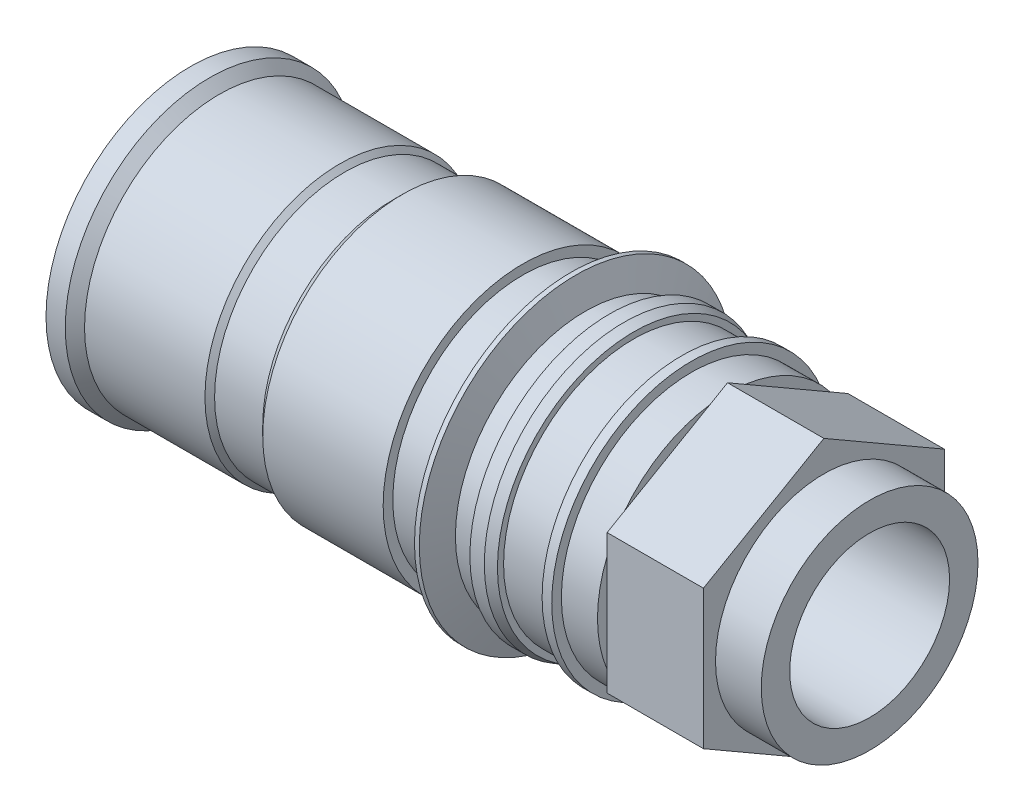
ISO-10303-21;
HEADER;
FILE_DESCRIPTION(('STEP AP214'),'2;1');
FILE_NAME('part.step','',(''),(''),'','','');
FILE_SCHEMA(('AUTOMOTIVE_DESIGN { 1 0 10303 214 1 1 1 1 }'));
ENDSEC;
DATA;
#1=APPLICATION_CONTEXT('core data for automotive mechanical design processes');
#2=APPLICATION_PROTOCOL_DEFINITION('international standard','automotive_design',2000,#1);
#3=PRODUCT_CONTEXT('',#1,'mechanical');
#4=PRODUCT('Part','Part','',(#3));
#5=PRODUCT_RELATED_PRODUCT_CATEGORY('part','',(#4));
#6=PRODUCT_DEFINITION_FORMATION('','',#4);
#7=PRODUCT_DEFINITION_CONTEXT('part definition',#1,'design');
#8=PRODUCT_DEFINITION('design','',#6,#7);
#9=PRODUCT_DEFINITION_SHAPE('','',#8);
#10=(LENGTH_UNIT() NAMED_UNIT(*) SI_UNIT(.MILLI.,.METRE.));
#11=(NAMED_UNIT(*) PLANE_ANGLE_UNIT() SI_UNIT($,.RADIAN.));
#12=(NAMED_UNIT(*) SI_UNIT($,.STERADIAN.) SOLID_ANGLE_UNIT());
#13=UNCERTAINTY_MEASURE_WITH_UNIT(LENGTH_MEASURE(1.E-05),#10,'distance_accuracy_value','');
#14=(GEOMETRIC_REPRESENTATION_CONTEXT(3) GLOBAL_UNCERTAINTY_ASSIGNED_CONTEXT((#13)) GLOBAL_UNIT_ASSIGNED_CONTEXT((#10,
#11,#12)) REPRESENTATION_CONTEXT('',''));
#15=CARTESIAN_POINT('',(0.,0.,0.));
#16=DIRECTION('',(0.,0.,1.));
#17=DIRECTION('',(1.,0.,0.));
#18=AXIS2_PLACEMENT_3D('',#15,#16,#17);
#19=CARTESIAN_POINT('',(111.5,27.,0.));
#20=DIRECTION('',(-1.,0.,0.));
#21=DIRECTION('',(0.,0.,1.));
#22=AXIS2_PLACEMENT_3D('',#19,#20,#21);
#23=PLANE('',#22);
#24=DIRECTION('',(0.,0.5,0.866025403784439));
#25=VECTOR('',#24,1.);
#26=CARTESIAN_POINT('',(111.5,14.4337567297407,-25.));
#27=LINE('',#26,#25);
#28=CARTESIAN_POINT('',(111.5,16.5516155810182,-21.3317608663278));
#29=VERTEX_POINT('',#28);
#30=CARTESIAN_POINT('',(111.5,26.7496546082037,-3.6682391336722));
#31=VERTEX_POINT('',#30);
#32=EDGE_CURVE('E42',#29,#31,#27,.T.);
#33=ORIENTED_EDGE('',*,*,#32,.F.);
#34=CARTESIAN_POINT('',(111.5,0.,0.));
#35=DIRECTION('',(-1.,0.,0.));
#36=DIRECTION('',(0.,0.,1.));
#37=AXIS2_PLACEMENT_3D('',#34,#35,#36);
#38=CIRCLE('',#37,27.);
#39=EDGE_CURVE('E297',#31,#29,#38,.T.);
#40=ORIENTED_EDGE('',*,*,#39,.F.);
#41=EDGE_LOOP('',(#33,#40));
#42=FACE_BOUND('',#41,.T.);
#43=ADVANCED_FACE('F33',(#42),#23,.F.);
#44=DIRECTION('',(0.,1.,0.));
#45=VECTOR('',#44,1.);
#46=CARTESIAN_POINT('',(111.5,-14.4337567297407,-25.));
#47=LINE('',#46,#45);
#48=CARTESIAN_POINT('',(111.5,-10.1980390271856,-25.));
#49=VERTEX_POINT('',#48);
#50=CARTESIAN_POINT('',(111.5,10.1980390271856,-25.));
#51=VERTEX_POINT('',#50);
#52=EDGE_CURVE('E243',#49,#51,#47,.T.);
#53=ORIENTED_EDGE('',*,*,#52,.F.);
#54=EDGE_CURVE('E291',#51,#49,#38,.T.);
#55=ORIENTED_EDGE('',*,*,#54,.F.);
#56=EDGE_LOOP('',(#53,#55));
#57=FACE_BOUND('',#56,.T.);
#58=ADVANCED_FACE('F324',(#57),#23,.F.);
#59=DIRECTION('',(0.,0.5,-0.866025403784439));
#60=VECTOR('',#59,1.);
#61=CARTESIAN_POINT('',(111.5,-28.8675134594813,0.));
#62=LINE('',#61,#60);
#63=CARTESIAN_POINT('',(111.5,-26.7496546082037,-3.6682391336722));
#64=VERTEX_POINT('',#63);
#65=CARTESIAN_POINT('',(111.5,-16.5516155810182,-21.3317608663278));
#66=VERTEX_POINT('',#65);
#67=EDGE_CURVE('E245',#64,#66,#62,.T.);
#68=ORIENTED_EDGE('',*,*,#67,.F.);
#69=EDGE_CURVE('E285',#66,#64,#38,.T.);
#70=ORIENTED_EDGE('',*,*,#69,.F.);
#71=EDGE_LOOP('',(#68,#70));
#72=FACE_BOUND('',#71,.T.);
#73=ADVANCED_FACE('F331',(#72),#23,.F.);
#74=DIRECTION('',(0.,-0.5,-0.866025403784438));
#75=VECTOR('',#74,1.);
#76=CARTESIAN_POINT('',(111.5,-14.4337567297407,25.));
#77=LINE('',#76,#75);
#78=CARTESIAN_POINT('',(111.5,-16.5516155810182,21.3317608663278));
#79=VERTEX_POINT('',#78);
#80=CARTESIAN_POINT('',(111.5,-26.7496546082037,3.66823913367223));
#81=VERTEX_POINT('',#80);
#82=EDGE_CURVE('E56',#79,#81,#77,.T.);
#83=ORIENTED_EDGE('',*,*,#82,.F.);
#84=EDGE_CURVE('E282',#81,#79,#38,.T.);
#85=ORIENTED_EDGE('',*,*,#84,.F.);
#86=EDGE_LOOP('',(#83,#85));
#87=FACE_BOUND('',#86,.T.);
#88=ADVANCED_FACE('F343',(#87),#23,.F.);
#89=DIRECTION('',(0.,-1.,0.));
#90=VECTOR('',#89,1.);
#91=CARTESIAN_POINT('',(111.5,14.4337567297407,25.));
#92=LINE('',#91,#90);
#93=CARTESIAN_POINT('',(111.5,10.1980390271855,25.));
#94=VERTEX_POINT('',#93);
#95=CARTESIAN_POINT('',(111.5,-10.1980390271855,25.));
#96=VERTEX_POINT('',#95);
#97=EDGE_CURVE('E229',#94,#96,#92,.T.);
#98=ORIENTED_EDGE('',*,*,#97,.F.);
#99=EDGE_CURVE('E49',#96,#94,#38,.T.);
#100=ORIENTED_EDGE('',*,*,#99,.F.);
#101=EDGE_LOOP('',(#98,#100));
#102=FACE_BOUND('',#101,.T.);
#103=ADVANCED_FACE('F336',(#102),#23,.F.);
#104=DIRECTION('',(0.,-0.5,0.866025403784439));
#105=VECTOR('',#104,1.);
#106=CARTESIAN_POINT('',(111.5,28.8675134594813,0.));
#107=LINE('',#106,#105);
#108=CARTESIAN_POINT('',(111.5,26.7496546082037,3.6682391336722));
#109=VERTEX_POINT('',#108);
#110=CARTESIAN_POINT('',(111.5,16.5516155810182,21.3317608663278));
#111=VERTEX_POINT('',#110);
#112=EDGE_CURVE('E225',#109,#111,#107,.T.);
#113=ORIENTED_EDGE('',*,*,#112,.F.);
#114=EDGE_CURVE('E161',#111,#109,#38,.T.);
#115=ORIENTED_EDGE('',*,*,#114,.F.);
#116=EDGE_LOOP('',(#113,#115));
#117=FACE_BOUND('',#116,.T.);
#118=ADVANCED_FACE('F327',(#117),#23,.F.);
#119=CARTESIAN_POINT('',(0.,0.,0.));
#120=DIRECTION('',(1.,0.,0.));
#121=DIRECTION('',(0.,0.,-1.));
#122=AXIS2_PLACEMENT_3D('',#119,#120,#121);
#123=PLANE('',#122);
#124=CARTESIAN_POINT('',(0.,0.,0.));
#125=DIRECTION('',(1.,0.,0.));
#126=DIRECTION('',(0.,0.,-1.));
#127=AXIS2_PLACEMENT_3D('',#124,#125,#126);
#128=CIRCLE('',#127,16.6);
#129=CARTESIAN_POINT('',(0.,0.,-16.6));
#130=VERTEX_POINT('',#129);
#131=EDGE_CURVE('E398',#130,#130,#128,.T.);
#132=ORIENTED_EDGE('',*,*,#131,.T.);
#133=EDGE_LOOP('',(#132));
#134=FACE_BOUND('',#133,.T.);
#135=CARTESIAN_POINT('',(0.,0.,0.));
#136=DIRECTION('',(-1.,0.,0.));
#137=DIRECTION('',(0.,0.,1.));
#138=AXIS2_PLACEMENT_3D('',#135,#136,#137);
#139=CIRCLE('',#138,30.);
#140=CARTESIAN_POINT('',(0.,0.,30.));
#141=VERTEX_POINT('',#140);
#142=EDGE_CURVE('E37',#141,#141,#139,.T.);
#143=ORIENTED_EDGE('',*,*,#142,.T.);
#144=EDGE_LOOP('',(#143));
#145=FACE_BOUND('',#144,.T.);
#146=ADVANCED_FACE('F35',(#134,#145),#123,.F.);
#147=CARTESIAN_POINT('',(0.,0.,0.));
#148=DIRECTION('',(-1.,0.,0.));
#149=DIRECTION('',(0.,0.,1.));
#150=AXIS2_PLACEMENT_3D('',#147,#148,#149);
#151=CYLINDRICAL_SURFACE('',#150,30.);
#152=ORIENTED_EDGE('',*,*,#142,.F.);
#153=EDGE_LOOP('',(#152));
#154=FACE_BOUND('',#153,.T.);
#155=CARTESIAN_POINT('',(4.,0.,0.));
#156=DIRECTION('',(-1.,0.,0.));
#157=DIRECTION('',(0.,0.,1.));
#158=AXIS2_PLACEMENT_3D('',#155,#156,#157);
#159=CIRCLE('',#158,30.);
#160=CARTESIAN_POINT('',(4.,0.,30.));
#161=VERTEX_POINT('',#160);
#162=EDGE_CURVE('E220',#161,#161,#159,.T.);
#163=ORIENTED_EDGE('',*,*,#162,.T.);
#164=EDGE_LOOP('',(#163));
#165=FACE_BOUND('',#164,.T.);
#166=ADVANCED_FACE('F341',(#154,#165),#151,.T.);
#167=CARTESIAN_POINT('',(6.,0.,0.));
#168=DIRECTION('',(-1.,0.,0.));
#169=DIRECTION('',(0.,0.,1.));
#170=AXIS2_PLACEMENT_3D('',#167,#168,#169);
#171=CONICAL_SURFACE('',#170,28.,0.78539816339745);
#172=ORIENTED_EDGE('',*,*,#162,.F.);
#173=EDGE_LOOP('',(#172));
#174=FACE_BOUND('',#173,.T.);
#175=CARTESIAN_POINT('',(6.,0.,0.));
#176=DIRECTION('',(-1.,0.,0.));
#177=DIRECTION('',(0.,0.,1.));
#178=AXIS2_PLACEMENT_3D('',#175,#176,#177);
#179=CIRCLE('',#178,28.);
#180=CARTESIAN_POINT('',(6.,0.,28.));
#181=VERTEX_POINT('',#180);
#182=EDGE_CURVE('E218',#181,#181,#179,.T.);
#183=ORIENTED_EDGE('',*,*,#182,.T.);
#184=EDGE_LOOP('',(#183));
#185=FACE_BOUND('',#184,.T.);
#186=ADVANCED_FACE('F440',(#174,#185),#171,.T.);
#187=CARTESIAN_POINT('',(0.,0.,0.));
#188=DIRECTION('',(-1.,0.,0.));
#189=DIRECTION('',(0.,0.,1.));
#190=AXIS2_PLACEMENT_3D('',#187,#188,#189);
#191=CYLINDRICAL_SURFACE('',#190,28.);
#192=ORIENTED_EDGE('',*,*,#182,.F.);
#193=EDGE_LOOP('',(#192));
#194=FACE_BOUND('',#193,.T.);
#195=CARTESIAN_POINT('',(31.,0.,0.));
#196=DIRECTION('',(-1.,0.,0.));
#197=DIRECTION('',(0.,0.,1.));
#198=AXIS2_PLACEMENT_3D('',#195,#196,#197);
#199=CIRCLE('',#198,28.);
#200=CARTESIAN_POINT('',(31.,0.,28.));
#201=VERTEX_POINT('',#200);
#202=EDGE_CURVE('E215',#201,#201,#199,.T.);
#203=ORIENTED_EDGE('',*,*,#202,.T.);
#204=EDGE_LOOP('',(#203));
#205=FACE_BOUND('',#204,.T.);
#206=ADVANCED_FACE('F446',(#194,#205),#191,.T.);
#207=CARTESIAN_POINT('',(32.,0.,0.));
#208=DIRECTION('',(-1.,0.,0.));
#209=DIRECTION('',(0.,0.,1.));
#210=AXIS2_PLACEMENT_3D('',#207,#208,#209);
#211=CONICAL_SURFACE('',#210,27.,0.785398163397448);
#212=ORIENTED_EDGE('',*,*,#202,.F.);
#213=EDGE_LOOP('',(#212));
#214=FACE_BOUND('',#213,.T.);
#215=CARTESIAN_POINT('',(32.,0.,0.));
#216=DIRECTION('',(-1.,0.,0.));
#217=DIRECTION('',(0.,0.,1.));
#218=AXIS2_PLACEMENT_3D('',#215,#216,#217);
#219=CIRCLE('',#218,27.);
#220=CARTESIAN_POINT('',(32.,0.,27.));
#221=VERTEX_POINT('',#220);
#222=EDGE_CURVE('E212',#221,#221,#219,.T.);
#223=ORIENTED_EDGE('',*,*,#222,.T.);
#224=EDGE_LOOP('',(#223));
#225=FACE_BOUND('',#224,.T.);
#226=ADVANCED_FACE('F454',(#214,#225),#211,.T.);
#227=CARTESIAN_POINT('',(0.,0.,0.));
#228=DIRECTION('',(-1.,0.,0.));
#229=DIRECTION('',(0.,0.,1.));
#230=AXIS2_PLACEMENT_3D('',#227,#228,#229);
#231=CYLINDRICAL_SURFACE('',#230,27.);
#232=ORIENTED_EDGE('',*,*,#222,.F.);
#233=EDGE_LOOP('',(#232));
#234=FACE_BOUND('',#233,.T.);
#235=CARTESIAN_POINT('',(42.,0.,0.));
#236=DIRECTION('',(-1.,0.,0.));
#237=DIRECTION('',(0.,0.,1.));
#238=AXIS2_PLACEMENT_3D('',#235,#236,#237);
#239=CIRCLE('',#238,27.);
#240=CARTESIAN_POINT('',(42.,0.,27.));
#241=VERTEX_POINT('',#240);
#242=EDGE_CURVE('E209',#241,#241,#239,.T.);
#243=ORIENTED_EDGE('',*,*,#242,.T.);
#244=EDGE_LOOP('',(#243));
#245=FACE_BOUND('',#244,.T.);
#246=ADVANCED_FACE('F462',(#234,#245),#231,.T.);
#247=CARTESIAN_POINT('',(44.,0.,0.));
#248=DIRECTION('',(1.,0.,0.));
#249=DIRECTION('',(0.,0.,-1.));
#250=AXIS2_PLACEMENT_3D('',#247,#248,#249);
#251=CONICAL_SURFACE('',#250,29.,0.785398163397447);
#252=ORIENTED_EDGE('',*,*,#242,.F.);
#253=EDGE_LOOP('',(#252));
#254=FACE_BOUND('',#253,.T.);
#255=CARTESIAN_POINT('',(44.,0.,0.));
#256=DIRECTION('',(-1.,0.,0.));
#257=DIRECTION('',(0.,0.,1.));
#258=AXIS2_PLACEMENT_3D('',#255,#256,#257);
#259=CIRCLE('',#258,29.);
#260=CARTESIAN_POINT('',(44.,0.,29.));
#261=VERTEX_POINT('',#260);
#262=EDGE_CURVE('E206',#261,#261,#259,.T.);
#263=ORIENTED_EDGE('',*,*,#262,.T.);
#264=EDGE_LOOP('',(#263));
#265=FACE_BOUND('',#264,.T.);
#266=ADVANCED_FACE('F470',(#254,#265),#251,.T.);
#267=CARTESIAN_POINT('',(0.,0.,0.));
#268=DIRECTION('',(-1.,0.,0.));
#269=DIRECTION('',(0.,0.,1.));
#270=AXIS2_PLACEMENT_3D('',#267,#268,#269);
#271=CYLINDRICAL_SURFACE('',#270,29.);
#272=ORIENTED_EDGE('',*,*,#262,.F.);
#273=EDGE_LOOP('',(#272));
#274=FACE_BOUND('',#273,.T.);
#275=CARTESIAN_POINT('',(69.,0.,0.));
#276=DIRECTION('',(-1.,0.,0.));
#277=DIRECTION('',(0.,0.,1.));
#278=AXIS2_PLACEMENT_3D('',#275,#276,#277);
#279=CIRCLE('',#278,29.);
#280=CARTESIAN_POINT('',(69.,0.,29.));
#281=VERTEX_POINT('',#280);
#282=EDGE_CURVE('E203',#281,#281,#279,.T.);
#283=ORIENTED_EDGE('',*,*,#282,.T.);
#284=EDGE_LOOP('',(#283));
#285=FACE_BOUND('',#284,.T.);
#286=ADVANCED_FACE('F478',(#274,#285),#271,.T.);
#287=CARTESIAN_POINT('',(69.,29.,0.));
#288=DIRECTION('',(-1.,0.,0.));
#289=DIRECTION('',(0.,0.,1.));
#290=AXIS2_PLACEMENT_3D('',#287,#288,#289);
#291=PLANE('',#290);
#292=ORIENTED_EDGE('',*,*,#282,.F.);
#293=EDGE_LOOP('',(#292));
#294=FACE_BOUND('',#293,.T.);
#295=CARTESIAN_POINT('',(69.,0.,0.));
#296=DIRECTION('',(-1.,0.,0.));
#297=DIRECTION('',(0.,0.,1.));
#298=AXIS2_PLACEMENT_3D('',#295,#296,#297);
#299=CIRCLE('',#298,27.);
#300=CARTESIAN_POINT('',(69.,0.,27.));
#301=VERTEX_POINT('',#300);
#302=EDGE_CURVE('E200',#301,#301,#299,.T.);
#303=ORIENTED_EDGE('',*,*,#302,.T.);
#304=EDGE_LOOP('',(#303));
#305=FACE_BOUND('',#304,.T.);
#306=ADVANCED_FACE('F486',(#294,#305),#291,.F.);
#307=CARTESIAN_POINT('',(0.,0.,0.));
#308=DIRECTION('',(-1.,0.,0.));
#309=DIRECTION('',(0.,0.,1.));
#310=AXIS2_PLACEMENT_3D('',#307,#308,#309);
#311=CYLINDRICAL_SURFACE('',#310,27.);
#312=ORIENTED_EDGE('',*,*,#302,.F.);
#313=EDGE_LOOP('',(#312));
#314=FACE_BOUND('',#313,.T.);
#315=CARTESIAN_POINT('',(77.,0.,0.));
#316=DIRECTION('',(-1.,0.,0.));
#317=DIRECTION('',(0.,0.,1.));
#318=AXIS2_PLACEMENT_3D('',#315,#316,#317);
#319=CIRCLE('',#318,27.);
#320=CARTESIAN_POINT('',(77.,0.,27.));
#321=VERTEX_POINT('',#320);
#322=EDGE_CURVE('E197',#321,#321,#319,.T.);
#323=ORIENTED_EDGE('',*,*,#322,.T.);
#324=EDGE_LOOP('',(#323));
#325=FACE_BOUND('',#324,.T.);
#326=ADVANCED_FACE('F494',(#314,#325),#311,.T.);
#327=CARTESIAN_POINT('',(79.,0.,0.));
#328=DIRECTION('',(1.,0.,0.));
#329=DIRECTION('',(0.,0.,-1.));
#330=AXIS2_PLACEMENT_3D('',#327,#328,#329);
#331=CONICAL_SURFACE('',#330,32.4949548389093,1.22173047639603);
#332=ORIENTED_EDGE('',*,*,#322,.F.);
#333=EDGE_LOOP('',(#332));
#334=FACE_BOUND('',#333,.T.);
#335=CARTESIAN_POINT('',(79.,0.,0.));
#336=DIRECTION('',(-1.,0.,0.));
#337=DIRECTION('',(0.,0.,1.));
#338=AXIS2_PLACEMENT_3D('',#335,#336,#337);
#339=CIRCLE('',#338,32.4949548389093);
#340=CARTESIAN_POINT('',(79.,0.,32.4949548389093));
#341=VERTEX_POINT('',#340);
#342=EDGE_CURVE('E194',#341,#341,#339,.T.);
#343=ORIENTED_EDGE('',*,*,#342,.T.);
#344=EDGE_LOOP('',(#343));
#345=FACE_BOUND('',#344,.T.);
#346=ADVANCED_FACE('F502',(#334,#345),#331,.T.);
#347=CARTESIAN_POINT('',(0.,0.,0.));
#348=DIRECTION('',(-1.,0.,0.));
#349=DIRECTION('',(0.,0.,1.));
#350=AXIS2_PLACEMENT_3D('',#347,#348,#349);
#351=CYLINDRICAL_SURFACE('',#350,32.4949548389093);
#352=ORIENTED_EDGE('',*,*,#342,.F.);
#353=EDGE_LOOP('',(#352));
#354=FACE_BOUND('',#353,.T.);
#355=CARTESIAN_POINT('',(80.,0.,0.));
#356=DIRECTION('',(-1.,0.,0.));
#357=DIRECTION('',(0.,0.,1.));
#358=AXIS2_PLACEMENT_3D('',#355,#356,#357);
#359=CIRCLE('',#358,32.4949548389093);
#360=CARTESIAN_POINT('',(80.,0.,32.4949548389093));
#361=VERTEX_POINT('',#360);
#362=EDGE_CURVE('E191',#361,#361,#359,.T.);
#363=ORIENTED_EDGE('',*,*,#362,.T.);
#364=EDGE_LOOP('',(#363));
#365=FACE_BOUND('',#364,.T.);
#366=ADVANCED_FACE('F510',(#354,#365),#351,.T.);
#367=CARTESIAN_POINT('',(82.,0.,0.));
#368=DIRECTION('',(-1.,0.,0.));
#369=DIRECTION('',(0.,0.,1.));
#370=AXIS2_PLACEMENT_3D('',#367,#368,#369);
#371=CONICAL_SURFACE('',#370,27.,1.22173047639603);
#372=ORIENTED_EDGE('',*,*,#362,.F.);
#373=EDGE_LOOP('',(#372));
#374=FACE_BOUND('',#373,.T.);
#375=CARTESIAN_POINT('',(82.,0.,0.));
#376=DIRECTION('',(-1.,0.,0.));
#377=DIRECTION('',(0.,0.,1.));
#378=AXIS2_PLACEMENT_3D('',#375,#376,#377);
#379=CIRCLE('',#378,27.);
#380=CARTESIAN_POINT('',(82.,0.,27.));
#381=VERTEX_POINT('',#380);
#382=EDGE_CURVE('E188',#381,#381,#379,.T.);
#383=ORIENTED_EDGE('',*,*,#382,.T.);
#384=EDGE_LOOP('',(#383));
#385=FACE_BOUND('',#384,.T.);
#386=ADVANCED_FACE('F518',(#374,#385),#371,.T.);
#387=CARTESIAN_POINT('',(0.,0.,0.));
#388=DIRECTION('',(-1.,0.,0.));
#389=DIRECTION('',(0.,0.,1.));
#390=AXIS2_PLACEMENT_3D('',#387,#388,#389);
#391=CYLINDRICAL_SURFACE('',#390,27.);
#392=ORIENTED_EDGE('',*,*,#382,.F.);
#393=EDGE_LOOP('',(#392));
#394=FACE_BOUND('',#393,.T.);
#395=CARTESIAN_POINT('',(87.,0.,0.));
#396=DIRECTION('',(-1.,0.,0.));
#397=DIRECTION('',(0.,0.,1.));
#398=AXIS2_PLACEMENT_3D('',#395,#396,#397);
#399=CIRCLE('',#398,27.);
#400=CARTESIAN_POINT('',(87.,0.,27.));
#401=VERTEX_POINT('',#400);
#402=EDGE_CURVE('E185',#401,#401,#399,.T.);
#403=ORIENTED_EDGE('',*,*,#402,.T.);
#404=EDGE_LOOP('',(#403));
#405=FACE_BOUND('',#404,.T.);
#406=ADVANCED_FACE('F526',(#394,#405),#391,.T.);
#407=CARTESIAN_POINT('',(87.,27.,0.));
#408=DIRECTION('',(1.,0.,0.));
#409=DIRECTION('',(0.,0.,-1.));
#410=AXIS2_PLACEMENT_3D('',#407,#408,#409);
#411=PLANE('',#410);
#412=ORIENTED_EDGE('',*,*,#402,.F.);
#413=EDGE_LOOP('',(#412));
#414=FACE_BOUND('',#413,.T.);
#415=CARTESIAN_POINT('',(87.,0.,0.));
#416=DIRECTION('',(-1.,0.,0.));
#417=DIRECTION('',(0.,0.,1.));
#418=AXIS2_PLACEMENT_3D('',#415,#416,#417);
#419=CIRCLE('',#418,29.);
#420=CARTESIAN_POINT('',(87.,0.,29.));
#421=VERTEX_POINT('',#420);
#422=EDGE_CURVE('E182',#421,#421,#419,.T.);
#423=ORIENTED_EDGE('',*,*,#422,.T.);
#424=EDGE_LOOP('',(#423));
#425=FACE_BOUND('',#424,.T.);
#426=ADVANCED_FACE('F534',(#414,#425),#411,.F.);
#427=CARTESIAN_POINT('',(0.,0.,0.));
#428=DIRECTION('',(-1.,0.,0.));
#429=DIRECTION('',(0.,0.,1.));
#430=AXIS2_PLACEMENT_3D('',#427,#428,#429);
#431=CYLINDRICAL_SURFACE('',#430,29.);
#432=ORIENTED_EDGE('',*,*,#422,.F.);
#433=EDGE_LOOP('',(#432));
#434=FACE_BOUND('',#433,.T.);
#435=CARTESIAN_POINT('',(90.,0.,0.));
#436=DIRECTION('',(-1.,0.,0.));
#437=DIRECTION('',(0.,0.,1.));
#438=AXIS2_PLACEMENT_3D('',#435,#436,#437);
#439=CIRCLE('',#438,29.);
#440=CARTESIAN_POINT('',(90.,0.,29.));
#441=VERTEX_POINT('',#440);
#442=EDGE_CURVE('E179',#441,#441,#439,.T.);
#443=ORIENTED_EDGE('',*,*,#442,.T.);
#444=EDGE_LOOP('',(#443));
#445=FACE_BOUND('',#444,.T.);
#446=ADVANCED_FACE('F542',(#434,#445),#431,.T.);
#447=CARTESIAN_POINT('',(92.,0.,0.));
#448=DIRECTION('',(-1.,0.,0.));
#449=DIRECTION('',(0.,0.,1.));
#450=AXIS2_PLACEMENT_3D('',#447,#448,#449);
#451=CONICAL_SURFACE('',#450,28.2720595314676,0.349065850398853);
#452=ORIENTED_EDGE('',*,*,#442,.F.);
#453=EDGE_LOOP('',(#452));
#454=FACE_BOUND('',#453,.T.);
#455=CARTESIAN_POINT('',(92.,0.,0.));
#456=DIRECTION('',(-1.,0.,0.));
#457=DIRECTION('',(0.,0.,1.));
#458=AXIS2_PLACEMENT_3D('',#455,#456,#457);
#459=CIRCLE('',#458,28.2720595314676);
#460=CARTESIAN_POINT('',(92.,0.,28.2720595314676));
#461=VERTEX_POINT('',#460);
#462=EDGE_CURVE('E176',#461,#461,#459,.T.);
#463=ORIENTED_EDGE('',*,*,#462,.T.);
#464=EDGE_LOOP('',(#463));
#465=FACE_BOUND('',#464,.T.);
#466=ADVANCED_FACE('F550',(#454,#465),#451,.T.);
#467=CARTESIAN_POINT('',(92.,28.2720595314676,0.));
#468=DIRECTION('',(-1.,0.,0.));
#469=DIRECTION('',(0.,0.,1.));
#470=AXIS2_PLACEMENT_3D('',#467,#468,#469);
#471=PLANE('',#470);
#472=ORIENTED_EDGE('',*,*,#462,.F.);
#473=EDGE_LOOP('',(#472));
#474=FACE_BOUND('',#473,.T.);
#475=CARTESIAN_POINT('',(92.,0.,0.));
#476=DIRECTION('',(-1.,0.,0.));
#477=DIRECTION('',(0.,0.,1.));
#478=AXIS2_PLACEMENT_3D('',#475,#476,#477);
#479=CIRCLE('',#478,27.);
#480=CARTESIAN_POINT('',(92.,0.,27.));
#481=VERTEX_POINT('',#480);
#482=EDGE_CURVE('E173',#481,#481,#479,.T.);
#483=ORIENTED_EDGE('',*,*,#482,.T.);
#484=EDGE_LOOP('',(#483));
#485=FACE_BOUND('',#484,.T.);
#486=ADVANCED_FACE('F558',(#474,#485),#471,.F.);
#487=CARTESIAN_POINT('',(0.,0.,0.));
#488=DIRECTION('',(-1.,0.,0.));
#489=DIRECTION('',(0.,0.,1.));
#490=AXIS2_PLACEMENT_3D('',#487,#488,#489);
#491=CYLINDRICAL_SURFACE('',#490,27.);
#492=ORIENTED_EDGE('',*,*,#482,.F.);
#493=EDGE_LOOP('',(#492));
#494=FACE_BOUND('',#493,.T.);
#495=CARTESIAN_POINT('',(102.,0.,0.));
#496=DIRECTION('',(-1.,0.,0.));
#497=DIRECTION('',(0.,0.,1.));
#498=AXIS2_PLACEMENT_3D('',#495,#496,#497);
#499=CIRCLE('',#498,27.);
#500=CARTESIAN_POINT('',(102.,0.,27.));
#501=VERTEX_POINT('',#500);
#502=EDGE_CURVE('E170',#501,#501,#499,.T.);
#503=ORIENTED_EDGE('',*,*,#502,.T.);
#504=EDGE_LOOP('',(#503));
#505=FACE_BOUND('',#504,.T.);
#506=ADVANCED_FACE('F566',(#494,#505),#491,.T.);
#507=CARTESIAN_POINT('',(102.,27.,0.));
#508=DIRECTION('',(1.,0.,0.));
#509=DIRECTION('',(0.,0.,-1.));
#510=AXIS2_PLACEMENT_3D('',#507,#508,#509);
#511=PLANE('',#510);
#512=ORIENTED_EDGE('',*,*,#502,.F.);
#513=EDGE_LOOP('',(#512));
#514=FACE_BOUND('',#513,.T.);
#515=CARTESIAN_POINT('',(102.,0.,0.));
#516=DIRECTION('',(-1.,0.,0.));
#517=DIRECTION('',(0.,0.,1.));
#518=AXIS2_PLACEMENT_3D('',#515,#516,#517);
#519=CIRCLE('',#518,29.);
#520=CARTESIAN_POINT('',(102.,0.,29.));
#521=VERTEX_POINT('',#520);
#522=EDGE_CURVE('E167',#521,#521,#519,.T.);
#523=ORIENTED_EDGE('',*,*,#522,.T.);
#524=EDGE_LOOP('',(#523));
#525=FACE_BOUND('',#524,.T.);
#526=ADVANCED_FACE('F574',(#514,#525),#511,.F.);
#527=CARTESIAN_POINT('',(0.,0.,0.));
#528=DIRECTION('',(-1.,0.,0.));
#529=DIRECTION('',(0.,0.,1.));
#530=AXIS2_PLACEMENT_3D('',#527,#528,#529);
#531=CYLINDRICAL_SURFACE('',#530,29.);
#532=ORIENTED_EDGE('',*,*,#522,.F.);
#533=EDGE_LOOP('',(#532));
#534=FACE_BOUND('',#533,.T.);
#535=CARTESIAN_POINT('',(104.,0.,0.));
#536=DIRECTION('',(-1.,0.,0.));
#537=DIRECTION('',(0.,0.,1.));
#538=AXIS2_PLACEMENT_3D('',#535,#536,#537);
#539=CIRCLE('',#538,29.);
#540=CARTESIAN_POINT('',(104.,0.,29.));
#541=VERTEX_POINT('',#540);
#542=EDGE_CURVE('E164',#541,#541,#539,.T.);
#543=ORIENTED_EDGE('',*,*,#542,.T.);
#544=EDGE_LOOP('',(#543));
#545=FACE_BOUND('',#544,.T.);
#546=ADVANCED_FACE('F582',(#534,#545),#531,.T.);
#547=CARTESIAN_POINT('',(104.,29.,0.));
#548=DIRECTION('',(-1.,0.,0.));
#549=DIRECTION('',(0.,0.,1.));
#550=AXIS2_PLACEMENT_3D('',#547,#548,#549);
#551=PLANE('',#550);
#552=ORIENTED_EDGE('',*,*,#542,.F.);
#553=EDGE_LOOP('',(#552));
#554=FACE_BOUND('',#553,.T.);
#555=CARTESIAN_POINT('',(104.,0.,0.));
#556=DIRECTION('',(-1.,0.,0.));
#557=DIRECTION('',(0.,0.,1.));
#558=AXIS2_PLACEMENT_3D('',#555,#556,#557);
#559=CIRCLE('',#558,27.);
#560=CARTESIAN_POINT('',(104.,0.,27.));
#561=VERTEX_POINT('',#560);
#562=EDGE_CURVE('E160',#561,#561,#559,.T.);
#563=ORIENTED_EDGE('',*,*,#562,.T.);
#564=EDGE_LOOP('',(#563));
#565=FACE_BOUND('',#564,.T.);
#566=ADVANCED_FACE('F590',(#554,#565),#551,.F.);
#567=CARTESIAN_POINT('',(0.,0.,0.));
#568=DIRECTION('',(-1.,0.,0.));
#569=DIRECTION('',(0.,0.,1.));
#570=AXIS2_PLACEMENT_3D('',#567,#568,#569);
#571=CYLINDRICAL_SURFACE('',#570,27.);
#572=ORIENTED_EDGE('',*,*,#562,.F.);
#573=EDGE_LOOP('',(#572));
#574=FACE_BOUND('',#573,.T.);
#575=EDGE_CURVE('E155',#94,#111,#38,.T.);
#576=ORIENTED_EDGE('',*,*,#575,.T.);
#577=ORIENTED_EDGE('',*,*,#114,.T.);
#578=EDGE_CURVE('E300',#109,#31,#38,.T.);
#579=ORIENTED_EDGE('',*,*,#578,.T.);
#580=ORIENTED_EDGE('',*,*,#39,.T.);
#581=EDGE_CURVE('E295',#29,#51,#38,.T.);
#582=ORIENTED_EDGE('',*,*,#581,.T.);
#583=ORIENTED_EDGE('',*,*,#54,.T.);
#584=EDGE_CURVE('E289',#49,#66,#38,.T.);
#585=ORIENTED_EDGE('',*,*,#584,.T.);
#586=ORIENTED_EDGE('',*,*,#69,.T.);
#587=EDGE_CURVE('E283',#64,#81,#38,.T.);
#588=ORIENTED_EDGE('',*,*,#587,.T.);
#589=ORIENTED_EDGE('',*,*,#84,.T.);
#590=EDGE_CURVE('E153',#79,#96,#38,.T.);
#591=ORIENTED_EDGE('',*,*,#590,.T.);
#592=ORIENTED_EDGE('',*,*,#99,.T.);
#593=EDGE_LOOP('',(#576,#577,#579,#580,#582,#583,#585,#586,#588,#589,#591,#592));
#594=FACE_BOUND('',#593,.T.);
#595=ADVANCED_FACE('F305',(#574,#594),#571,.T.);
#596=CARTESIAN_POINT('',(111.5,0.,0.));
#597=DIRECTION('',(1.,0.,0.));
#598=DIRECTION('',(0.,0.,-1.));
#599=AXIS2_PLACEMENT_3D('',#596,#597,#598);
#600=PLANE('',#599);
#601=ORIENTED_EDGE('',*,*,#575,.F.);
#602=CARTESIAN_POINT('',(111.5,14.4337567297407,25.));
#603=VERTEX_POINT('',#602);
#604=EDGE_CURVE('E235',#603,#94,#92,.T.);
#605=ORIENTED_EDGE('',*,*,#604,.F.);
#606=EDGE_CURVE('E232',#111,#603,#107,.T.);
#607=ORIENTED_EDGE('',*,*,#606,.F.);
#608=EDGE_LOOP('',(#601,#605,#607));
#609=FACE_BOUND('',#608,.T.);
#610=ADVANCED_FACE('F312',(#609),#600,.F.);
#611=ORIENTED_EDGE('',*,*,#578,.F.);
#612=CARTESIAN_POINT('',(111.5,28.8675134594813,0.));
#613=VERTEX_POINT('',#612);
#614=EDGE_CURVE('E231',#613,#109,#107,.T.);
#615=ORIENTED_EDGE('',*,*,#614,.F.);
#616=EDGE_CURVE('E150',#31,#613,#27,.T.);
#617=ORIENTED_EDGE('',*,*,#616,.F.);
#618=EDGE_LOOP('',(#611,#615,#617));
#619=FACE_BOUND('',#618,.T.);
#620=ADVANCED_FACE('F309',(#619),#600,.F.);
#621=ORIENTED_EDGE('',*,*,#581,.F.);
#622=CARTESIAN_POINT('',(111.5,14.4337567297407,-25.));
#623=VERTEX_POINT('',#622);
#624=EDGE_CURVE('E238',#623,#29,#27,.T.);
#625=ORIENTED_EDGE('',*,*,#624,.F.);
#626=EDGE_CURVE('E247',#51,#623,#47,.T.);
#627=ORIENTED_EDGE('',*,*,#626,.F.);
#628=EDGE_LOOP('',(#621,#625,#627));
#629=FACE_BOUND('',#628,.T.);
#630=ADVANCED_FACE('F311',(#629),#600,.F.);
#631=ORIENTED_EDGE('',*,*,#584,.F.);
#632=CARTESIAN_POINT('',(111.5,-14.4337567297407,-25.));
#633=VERTEX_POINT('',#632);
#634=EDGE_CURVE('E144',#633,#49,#47,.T.);
#635=ORIENTED_EDGE('',*,*,#634,.F.);
#636=EDGE_CURVE('E253',#66,#633,#62,.T.);
#637=ORIENTED_EDGE('',*,*,#636,.F.);
#638=EDGE_LOOP('',(#631,#635,#637));
#639=FACE_BOUND('',#638,.T.);
#640=ADVANCED_FACE('F318',(#639),#600,.F.);
#641=ORIENTED_EDGE('',*,*,#587,.F.);
#642=CARTESIAN_POINT('',(111.5,-28.8675134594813,0.));
#643=VERTEX_POINT('',#642);
#644=EDGE_CURVE('E252',#643,#64,#62,.T.);
#645=ORIENTED_EDGE('',*,*,#644,.F.);
#646=EDGE_CURVE('E263',#81,#643,#77,.T.);
#647=ORIENTED_EDGE('',*,*,#646,.F.);
#648=EDGE_LOOP('',(#641,#645,#647));
#649=FACE_BOUND('',#648,.T.);
#650=ADVANCED_FACE('F364',(#649),#600,.F.);
#651=CARTESIAN_POINT('',(131.5,14.4337567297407,-25.));
#652=DIRECTION('',(0.,-0.866025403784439,0.5));
#653=DIRECTION('',(0.,-0.5,-0.866025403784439));
#654=AXIS2_PLACEMENT_3D('',#651,#652,#653);
#655=PLANE('',#654);
#656=ORIENTED_EDGE('',*,*,#624,.T.);
#657=ORIENTED_EDGE('',*,*,#32,.T.);
#658=ORIENTED_EDGE('',*,*,#616,.T.);
#659=DIRECTION('',(-1.,0.,0.));
#660=VECTOR('',#659,1.);
#661=CARTESIAN_POINT('',(131.5,28.8675134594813,0.));
#662=LINE('',#661,#660);
#663=CARTESIAN_POINT('',(131.5,28.8675134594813,0.));
#664=VERTEX_POINT('',#663);
#665=EDGE_CURVE('E129',#664,#613,#662,.T.);
#666=ORIENTED_EDGE('',*,*,#665,.F.);
#667=DIRECTION('',(0.,0.5,0.866025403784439));
#668=VECTOR('',#667,1.);
#669=CARTESIAN_POINT('',(131.5,14.4337567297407,-25.));
#670=LINE('',#669,#668);
#671=CARTESIAN_POINT('',(131.5,14.4337567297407,-25.));
#672=VERTEX_POINT('',#671);
#673=EDGE_CURVE('E135',#672,#664,#670,.T.);
#674=ORIENTED_EDGE('',*,*,#673,.F.);
#675=DIRECTION('',(-1.,0.,0.));
#676=VECTOR('',#675,1.);
#677=CARTESIAN_POINT('',(131.5,14.4337567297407,-25.));
#678=LINE('',#677,#676);
#679=EDGE_CURVE('E361',#672,#623,#678,.T.);
#680=ORIENTED_EDGE('',*,*,#679,.T.);
#681=EDGE_LOOP('',(#656,#657,#658,#666,#674,#680));
#682=FACE_BOUND('',#681,.T.);
#683=ADVANCED_FACE('F147',(#682),#655,.F.);
#684=CARTESIAN_POINT('',(131.5,28.8675134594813,0.));
#685=DIRECTION('',(0.,-0.866025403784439,-0.5));
#686=DIRECTION('',(0.,0.5,-0.866025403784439));
#687=AXIS2_PLACEMENT_3D('',#684,#685,#686);
#688=PLANE('',#687);
#689=ORIENTED_EDGE('',*,*,#614,.T.);
#690=ORIENTED_EDGE('',*,*,#112,.T.);
#691=ORIENTED_EDGE('',*,*,#606,.T.);
#692=DIRECTION('',(-1.,0.,0.));
#693=VECTOR('',#692,1.);
#694=CARTESIAN_POINT('',(131.5,14.4337567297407,25.));
#695=LINE('',#694,#693);
#696=CARTESIAN_POINT('',(131.5,14.4337567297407,25.));
#697=VERTEX_POINT('',#696);
#698=EDGE_CURVE('E131',#697,#603,#695,.T.);
#699=ORIENTED_EDGE('',*,*,#698,.F.);
#700=DIRECTION('',(0.,-0.5,0.866025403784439));
#701=VECTOR('',#700,1.);
#702=CARTESIAN_POINT('',(131.5,28.8675134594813,0.));
#703=LINE('',#702,#701);
#704=EDGE_CURVE('E124',#664,#697,#703,.T.);
#705=ORIENTED_EDGE('',*,*,#704,.F.);
#706=ORIENTED_EDGE('',*,*,#665,.T.);
#707=EDGE_LOOP('',(#689,#690,#691,#699,#705,#706));
#708=FACE_BOUND('',#707,.T.);
#709=ADVANCED_FACE('F127',(#708),#688,.F.);
#710=CARTESIAN_POINT('',(131.5,14.4337567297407,25.));
#711=DIRECTION('',(0.,0.,-1.));
#712=DIRECTION('',(-1.,0.,0.));
#713=AXIS2_PLACEMENT_3D('',#710,#711,#712);
#714=PLANE('',#713);
#715=ORIENTED_EDGE('',*,*,#604,.T.);
#716=ORIENTED_EDGE('',*,*,#97,.T.);
#717=CARTESIAN_POINT('',(111.5,-14.4337567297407,25.));
#718=VERTEX_POINT('',#717);
#719=EDGE_CURVE('E236',#96,#718,#92,.T.);
#720=ORIENTED_EDGE('',*,*,#719,.T.);
#721=DIRECTION('',(-1.,0.,0.));
#722=VECTOR('',#721,1.);
#723=CARTESIAN_POINT('',(131.5,-14.4337567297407,25.));
#724=LINE('',#723,#722);
#725=CARTESIAN_POINT('',(131.5,-14.4337567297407,25.));
#726=VERTEX_POINT('',#725);
#727=EDGE_CURVE('E156',#726,#718,#724,.T.);
#728=ORIENTED_EDGE('',*,*,#727,.F.);
#729=DIRECTION('',(0.,-1.,0.));
#730=VECTOR('',#729,1.);
#731=CARTESIAN_POINT('',(131.5,14.4337567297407,25.));
#732=LINE('',#731,#730);
#733=EDGE_CURVE('E134',#697,#726,#732,.T.);
#734=ORIENTED_EDGE('',*,*,#733,.F.);
#735=ORIENTED_EDGE('',*,*,#698,.T.);
#736=EDGE_LOOP('',(#715,#716,#720,#728,#734,#735));
#737=FACE_BOUND('',#736,.T.);
#738=ADVANCED_FACE('F270',(#737),#714,.F.);
#739=CARTESIAN_POINT('',(131.5,-14.4337567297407,25.));
#740=DIRECTION('',(0.,0.866025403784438,-0.5));
#741=DIRECTION('',(0.,0.5,0.866025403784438));
#742=AXIS2_PLACEMENT_3D('',#739,#740,#741);
#743=PLANE('',#742);
#744=EDGE_CURVE('E260',#718,#79,#77,.T.);
#745=ORIENTED_EDGE('',*,*,#744,.T.);
#746=ORIENTED_EDGE('',*,*,#82,.T.);
#747=ORIENTED_EDGE('',*,*,#646,.T.);
#748=DIRECTION('',(-1.,0.,0.));
#749=VECTOR('',#748,1.);
#750=CARTESIAN_POINT('',(131.5,-28.8675134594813,0.));
#751=LINE('',#750,#749);
#752=CARTESIAN_POINT('',(131.5,-28.8675134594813,0.));
#753=VERTEX_POINT('',#752);
#754=EDGE_CURVE('E279',#753,#643,#751,.T.);
#755=ORIENTED_EDGE('',*,*,#754,.F.);
#756=DIRECTION('',(0.,-0.5,-0.866025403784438));
#757=VECTOR('',#756,1.);
#758=CARTESIAN_POINT('',(131.5,-14.4337567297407,25.));
#759=LINE('',#758,#757);
#760=EDGE_CURVE('E278',#726,#753,#759,.T.);
#761=ORIENTED_EDGE('',*,*,#760,.F.);
#762=ORIENTED_EDGE('',*,*,#727,.T.);
#763=EDGE_LOOP('',(#745,#746,#747,#755,#761,#762));
#764=FACE_BOUND('',#763,.T.);
#765=ADVANCED_FACE('F276',(#764),#743,.F.);
#766=CARTESIAN_POINT('',(131.5,-28.8675134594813,0.));
#767=DIRECTION('',(0.,0.866025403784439,0.5));
#768=DIRECTION('',(0.,-0.5,0.866025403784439));
#769=AXIS2_PLACEMENT_3D('',#766,#767,#768);
#770=PLANE('',#769);
#771=ORIENTED_EDGE('',*,*,#644,.T.);
#772=ORIENTED_EDGE('',*,*,#67,.T.);
#773=ORIENTED_EDGE('',*,*,#636,.T.);
#774=DIRECTION('',(-1.,0.,0.));
#775=VECTOR('',#774,1.);
#776=CARTESIAN_POINT('',(131.5,-14.4337567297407,-25.));
#777=LINE('',#776,#775);
#778=CARTESIAN_POINT('',(131.5,-14.4337567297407,-25.));
#779=VERTEX_POINT('',#778);
#780=EDGE_CURVE('E357',#779,#633,#777,.T.);
#781=ORIENTED_EDGE('',*,*,#780,.F.);
#782=DIRECTION('',(0.,0.5,-0.866025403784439));
#783=VECTOR('',#782,1.);
#784=CARTESIAN_POINT('',(131.5,-28.8675134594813,0.));
#785=LINE('',#784,#783);
#786=EDGE_CURVE('E409',#753,#779,#785,.T.);
#787=ORIENTED_EDGE('',*,*,#786,.F.);
#788=ORIENTED_EDGE('',*,*,#754,.T.);
#789=EDGE_LOOP('',(#771,#772,#773,#781,#787,#788));
#790=FACE_BOUND('',#789,.T.);
#791=ADVANCED_FACE('F353',(#790),#770,.F.);
#792=CARTESIAN_POINT('',(131.5,-14.4337567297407,-25.));
#793=DIRECTION('',(0.,0.,1.));
#794=DIRECTION('',(0.,-1.,0.));
#795=AXIS2_PLACEMENT_3D('',#792,#793,#794);
#796=PLANE('',#795);
#797=ORIENTED_EDGE('',*,*,#634,.T.);
#798=ORIENTED_EDGE('',*,*,#52,.T.);
#799=ORIENTED_EDGE('',*,*,#626,.T.);
#800=ORIENTED_EDGE('',*,*,#679,.F.);
#801=DIRECTION('',(0.,1.,0.));
#802=VECTOR('',#801,1.);
#803=CARTESIAN_POINT('',(131.5,-14.4337567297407,-25.));
#804=LINE('',#803,#802);
#805=EDGE_CURVE('E140',#779,#672,#804,.T.);
#806=ORIENTED_EDGE('',*,*,#805,.F.);
#807=ORIENTED_EDGE('',*,*,#780,.T.);
#808=EDGE_LOOP('',(#797,#798,#799,#800,#806,#807));
#809=FACE_BOUND('',#808,.T.);
#810=ADVANCED_FACE('F360',(#809),#796,.F.);
#811=CARTESIAN_POINT('',(131.5,0.,0.));
#812=DIRECTION('',(1.,0.,0.));
#813=DIRECTION('',(0.,0.,-1.));
#814=AXIS2_PLACEMENT_3D('',#811,#812,#813);
#815=PLANE('',#814);
#816=CARTESIAN_POINT('',(131.5,0.,0.));
#817=DIRECTION('',(1.,0.,0.));
#818=DIRECTION('',(0.,0.,-1.));
#819=AXIS2_PLACEMENT_3D('',#816,#817,#818);
#820=CIRCLE('',#819,22.5);
#821=CARTESIAN_POINT('',(131.5,0.,-22.5));
#822=VERTEX_POINT('',#821);
#823=EDGE_CURVE('E11',#822,#822,#820,.T.);
#824=ORIENTED_EDGE('',*,*,#823,.F.);
#825=EDGE_LOOP('',(#824));
#826=FACE_BOUND('',#825,.T.);
#827=ORIENTED_EDGE('',*,*,#673,.T.);
#828=ORIENTED_EDGE('',*,*,#704,.T.);
#829=ORIENTED_EDGE('',*,*,#733,.T.);
#830=ORIENTED_EDGE('',*,*,#760,.T.);
#831=ORIENTED_EDGE('',*,*,#786,.T.);
#832=ORIENTED_EDGE('',*,*,#805,.T.);
#833=EDGE_LOOP('',(#827,#828,#829,#830,#831,#832));
#834=FACE_BOUND('',#833,.T.);
#835=ADVANCED_FACE('F138',(#826,#834),#815,.T.);
#836=ORIENTED_EDGE('',*,*,#590,.F.);
#837=ORIENTED_EDGE('',*,*,#744,.F.);
#838=ORIENTED_EDGE('',*,*,#719,.F.);
#839=EDGE_LOOP('',(#836,#837,#838));
#840=FACE_BOUND('',#839,.T.);
#841=ADVANCED_FACE('F280',(#840),#600,.F.);
#842=CARTESIAN_POINT('',(141.,0.,0.));
#843=DIRECTION('',(-1.,0.,0.));
#844=DIRECTION('',(0.,0.,1.));
#845=AXIS2_PLACEMENT_3D('',#842,#843,#844);
#846=CYLINDRICAL_SURFACE('',#845,22.5);
#847=CARTESIAN_POINT('',(141.,0.,0.));
#848=DIRECTION('',(1.,0.,0.));
#849=DIRECTION('',(0.,0.,-1.));
#850=AXIS2_PLACEMENT_3D('',#847,#848,#849);
#851=CIRCLE('',#850,22.5);
#852=CARTESIAN_POINT('',(141.,0.,-22.5));
#853=VERTEX_POINT('',#852);
#854=EDGE_CURVE('E241',#853,#853,#851,.T.);
#855=ORIENTED_EDGE('',*,*,#854,.F.);
#856=EDGE_LOOP('',(#855));
#857=FACE_BOUND('',#856,.T.);
#858=ORIENTED_EDGE('',*,*,#823,.T.);
#859=EDGE_LOOP('',(#858));
#860=FACE_BOUND('',#859,.T.);
#861=ADVANCED_FACE('F373',(#857,#860),#846,.T.);
#862=CARTESIAN_POINT('',(141.,0.,0.));
#863=DIRECTION('',(1.,0.,0.));
#864=DIRECTION('',(0.,0.,-1.));
#865=AXIS2_PLACEMENT_3D('',#862,#863,#864);
#866=PLANE('',#865);
#867=CARTESIAN_POINT('',(141.,0.,0.));
#868=DIRECTION('',(1.,0.,0.));
#869=DIRECTION('',(0.,0.,-1.));
#870=AXIS2_PLACEMENT_3D('',#867,#868,#869);
#871=CIRCLE('',#870,16.6);
#872=CARTESIAN_POINT('',(141.,0.,-16.6));
#873=VERTEX_POINT('',#872);
#874=EDGE_CURVE('E401',#873,#873,#871,.T.);
#875=ORIENTED_EDGE('',*,*,#874,.F.);
#876=EDGE_LOOP('',(#875));
#877=FACE_BOUND('',#876,.T.);
#878=ORIENTED_EDGE('',*,*,#854,.T.);
#879=EDGE_LOOP('',(#878));
#880=FACE_BOUND('',#879,.T.);
#881=ADVANCED_FACE('F378',(#877,#880),#866,.T.);
#882=CARTESIAN_POINT('',(0.,0.,0.));
#883=DIRECTION('',(1.,0.,0.));
#884=DIRECTION('',(0.,0.,-1.));
#885=AXIS2_PLACEMENT_3D('',#882,#883,#884);
#886=CYLINDRICAL_SURFACE('',#885,16.6);
#887=ORIENTED_EDGE('',*,*,#131,.F.);
#888=EDGE_LOOP('',(#887));
#889=FACE_BOUND('',#888,.T.);
#890=ORIENTED_EDGE('',*,*,#874,.T.);
#891=EDGE_LOOP('',(#890));
#892=FACE_BOUND('',#891,.T.);
#893=ADVANCED_FACE('F389',(#889,#892),#886,.F.);
#894=CLOSED_SHELL('',(#43,#58,#73,#88,#103,#118,#146,#166,#186,#206,#226,#246,#266,#286,#306,
#326,#346,#366,#386,#406,#426,#446,#466,#486,#506,#526,#546,#566,#595,#610,#620,#630,#640,#650,
#683,#709,#738,#765,#791,#810,#835,#841,#861,#881,#893));
#895=MANIFOLD_SOLID_BREP('B2',#894);
#896=ADVANCED_BREP_SHAPE_REPRESENTATION('',(#18,#895),#14);
#897=SHAPE_DEFINITION_REPRESENTATION(#9,#896);
ENDSEC;
END-ISO-10303-21;
